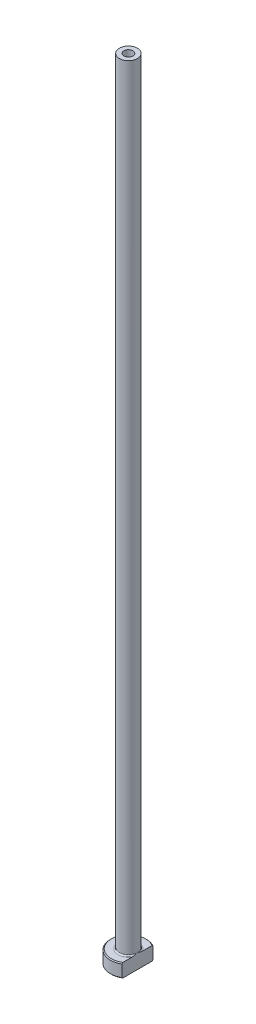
ISO-10303-21;
HEADER;
FILE_DESCRIPTION(('STEP AP214'),'2;1');
FILE_NAME('part.step','',(''),(''),'','','');
FILE_SCHEMA(('AUTOMOTIVE_DESIGN { 1 0 10303 214 1 1 1 1 }'));
ENDSEC;
DATA;
#1=APPLICATION_CONTEXT('core data for automotive mechanical design processes');
#2=APPLICATION_PROTOCOL_DEFINITION('international standard','automotive_design',2000,#1);
#3=PRODUCT_CONTEXT('',#1,'mechanical');
#4=PRODUCT('Part','Part','',(#3));
#5=PRODUCT_RELATED_PRODUCT_CATEGORY('part','',(#4));
#6=PRODUCT_DEFINITION_FORMATION('','',#4);
#7=PRODUCT_DEFINITION_CONTEXT('part definition',#1,'design');
#8=PRODUCT_DEFINITION('design','',#6,#7);
#9=PRODUCT_DEFINITION_SHAPE('','',#8);
#10=(LENGTH_UNIT() NAMED_UNIT(*) SI_UNIT(.MILLI.,.METRE.));
#11=(NAMED_UNIT(*) PLANE_ANGLE_UNIT() SI_UNIT($,.RADIAN.));
#12=(NAMED_UNIT(*) SI_UNIT($,.STERADIAN.) SOLID_ANGLE_UNIT());
#13=UNCERTAINTY_MEASURE_WITH_UNIT(LENGTH_MEASURE(1.E-05),#10,'distance_accuracy_value','');
#14=(GEOMETRIC_REPRESENTATION_CONTEXT(3) GLOBAL_UNCERTAINTY_ASSIGNED_CONTEXT((#13)) GLOBAL_UNIT_ASSIGNED_CONTEXT((#10,
#11,#12)) REPRESENTATION_CONTEXT('',''));
#15=CARTESIAN_POINT('',(0.,0.,0.));
#16=DIRECTION('',(0.,0.,1.));
#17=DIRECTION('',(1.,0.,0.));
#18=AXIS2_PLACEMENT_3D('',#15,#16,#17);
#19=CARTESIAN_POINT('',(0.,92.1876809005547,0.));
#20=DIRECTION('',(0.,1.,0.));
#21=DIRECTION('',(0.,0.,1.));
#22=AXIS2_PLACEMENT_3D('',#19,#20,#21);
#23=CYLINDRICAL_SURFACE('',#22,1.);
#24=CARTESIAN_POINT('',(0.,175.,0.));
#25=DIRECTION('',(0.,1.,0.));
#26=DIRECTION('',(0.,0.,1.));
#27=AXIS2_PLACEMENT_3D('',#24,#25,#26);
#28=CIRCLE('',#27,1.);
#29=CARTESIAN_POINT('',(0.,175.,1.));
#30=VERTEX_POINT('',#29);
#31=EDGE_CURVE('E167',#30,#30,#28,.T.);
#32=ORIENTED_EDGE('',*,*,#31,.T.);
#33=EDGE_LOOP('',(#32));
#34=FACE_BOUND('',#33,.T.);
#35=CARTESIAN_POINT('',(0.,140.,0.));
#36=DIRECTION('',(0.,1.,0.));
#37=DIRECTION('',(0.,0.,1.));
#38=AXIS2_PLACEMENT_3D('',#35,#36,#37);
#39=CIRCLE('',#38,1.);
#40=CARTESIAN_POINT('',(0.,140.,1.));
#41=VERTEX_POINT('',#40);
#42=EDGE_CURVE('E170',#41,#41,#39,.T.);
#43=ORIENTED_EDGE('',*,*,#42,.F.);
#44=EDGE_LOOP('',(#43));
#45=FACE_BOUND('',#44,.T.);
#46=ADVANCED_FACE('F32',(#34,#45),#23,.F.);
#47=CARTESIAN_POINT('',(-1.,175.,0.));
#48=DIRECTION('',(0.,1.,0.));
#49=DIRECTION('',(0.,0.,1.));
#50=AXIS2_PLACEMENT_3D('',#47,#48,#49);
#51=PLANE('',#50);
#52=CARTESIAN_POINT('',(0.,175.,0.));
#53=DIRECTION('',(0.,1.,0.));
#54=DIRECTION('',(0.,0.,1.));
#55=AXIS2_PLACEMENT_3D('',#52,#53,#54);
#56=CIRCLE('',#55,2.00000000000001);
#57=CARTESIAN_POINT('',(0.,175.,2.00000000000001));
#58=VERTEX_POINT('',#57);
#59=EDGE_CURVE('E174',#58,#58,#56,.T.);
#60=ORIENTED_EDGE('',*,*,#59,.T.);
#61=EDGE_LOOP('',(#60));
#62=FACE_BOUND('',#61,.T.);
#63=ORIENTED_EDGE('',*,*,#31,.F.);
#64=EDGE_LOOP('',(#63));
#65=FACE_BOUND('',#64,.T.);
#66=ADVANCED_FACE('F157',(#62,#65),#51,.T.);
#67=CARTESIAN_POINT('',(0.,92.1876809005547,0.));
#68=DIRECTION('',(0.,1.,0.));
#69=DIRECTION('',(0.,0.,1.));
#70=AXIS2_PLACEMENT_3D('',#67,#68,#69);
#71=CYLINDRICAL_SURFACE('',#70,2.);
#72=CARTESIAN_POINT('',(0.,3.3,0.));
#73=DIRECTION('',(0.,1.,0.));
#74=DIRECTION('',(0.,0.,1.));
#75=AXIS2_PLACEMENT_3D('',#72,#73,#74);
#76=CIRCLE('',#75,2.);
#77=CARTESIAN_POINT('',(2.,3.3,0.));
#78=VERTEX_POINT('',#77);
#79=EDGE_CURVE('E180',#78,#78,#76,.T.);
#80=ORIENTED_EDGE('',*,*,#79,.T.);
#81=EDGE_LOOP('',(#80));
#82=FACE_BOUND('',#81,.T.);
#83=ORIENTED_EDGE('',*,*,#59,.F.);
#84=EDGE_LOOP('',(#83));
#85=FACE_BOUND('',#84,.T.);
#86=ADVANCED_FACE('F162',(#82,#85),#71,.T.);
#87=CARTESIAN_POINT('',(-1.99999999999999,3.,0.));
#88=DIRECTION('',(0.,1.,0.));
#89=DIRECTION('',(0.,0.,1.));
#90=AXIS2_PLACEMENT_3D('',#87,#88,#89);
#91=PLANE('',#90);
#92=DIRECTION('',(0.,0.,1.));
#93=VECTOR('',#92,1.);
#94=CARTESIAN_POINT('',(2.,3.,0.));
#95=LINE('',#94,#93);
#96=CARTESIAN_POINT('',(2.,3.,-3.23109888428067));
#97=VERTEX_POINT('',#96);
#98=CARTESIAN_POINT('',(2.,3.,-1.13578166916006));
#99=VERTEX_POINT('',#98);
#100=EDGE_CURVE('E54',#97,#99,#95,.T.);
#101=ORIENTED_EDGE('',*,*,#100,.F.);
#102=CARTESIAN_POINT('',(0.,3.,0.));
#103=DIRECTION('',(0.,1.,0.));
#104=DIRECTION('',(0.,0.,1.));
#105=AXIS2_PLACEMENT_3D('',#102,#103,#104);
#106=CIRCLE('',#105,3.79999999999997);
#107=CARTESIAN_POINT('',(1.99999999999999,2.99999999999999,3.23109888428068));
#108=VERTEX_POINT('',#107);
#109=EDGE_CURVE('E186',#97,#108,#106,.T.);
#110=ORIENTED_EDGE('',*,*,#109,.T.);
#111=CARTESIAN_POINT('',(2.,3.,1.13578166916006));
#112=VERTEX_POINT('',#111);
#113=EDGE_CURVE('E134',#112,#108,#95,.T.);
#114=ORIENTED_EDGE('',*,*,#113,.F.);
#115=CARTESIAN_POINT('',(0.,3.,0.));
#116=DIRECTION('',(0.,1.,0.));
#117=DIRECTION('',(0.,0.,1.));
#118=AXIS2_PLACEMENT_3D('',#115,#116,#117);
#119=CIRCLE('',#118,2.3);
#120=EDGE_CURVE('E183',#112,#99,#119,.F.);
#121=ORIENTED_EDGE('',*,*,#120,.T.);
#122=EDGE_LOOP('',(#101,#110,#114,#121));
#123=FACE_BOUND('',#122,.T.);
#124=ADVANCED_FACE('F197',(#123),#91,.T.);
#125=CARTESIAN_POINT('',(0.,92.1876809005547,0.));
#126=DIRECTION('',(0.,1.,0.));
#127=DIRECTION('',(0.,0.,1.));
#128=AXIS2_PLACEMENT_3D('',#125,#126,#127);
#129=CYLINDRICAL_SURFACE('',#128,3.99999999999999);
#130=DIRECTION('',(0.,-1.,0.));
#131=VECTOR('',#130,1.);
#132=CARTESIAN_POINT('',(1.99999999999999,175.,3.46410161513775));
#133=LINE('',#132,#131);
#134=CARTESIAN_POINT('',(1.99999999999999,2.79999999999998,3.46410161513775));
#135=VERTEX_POINT('',#134);
#136=CARTESIAN_POINT('',(1.99999999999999,0.199999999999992,3.46410161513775));
#137=VERTEX_POINT('',#136);
#138=EDGE_CURVE('E82',#135,#137,#133,.T.);
#139=ORIENTED_EDGE('',*,*,#138,.F.);
#140=CARTESIAN_POINT('',(0.,2.79999999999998,0.));
#141=DIRECTION('',(0.,1.,0.));
#142=DIRECTION('',(0.,0.,1.));
#143=AXIS2_PLACEMENT_3D('',#140,#141,#142);
#144=CIRCLE('',#143,3.99999999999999);
#145=CARTESIAN_POINT('',(2.,2.79999999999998,-3.46410161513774));
#146=VERTEX_POINT('',#145);
#147=EDGE_CURVE('E95',#135,#146,#144,.F.);
#148=ORIENTED_EDGE('',*,*,#147,.T.);
#149=DIRECTION('',(0.,-1.,0.));
#150=VECTOR('',#149,1.);
#151=CARTESIAN_POINT('',(2.,175.,-3.46410161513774));
#152=LINE('',#151,#150);
#153=CARTESIAN_POINT('',(2.,0.199999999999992,-3.46410161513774));
#154=VERTEX_POINT('',#153);
#155=EDGE_CURVE('E192',#146,#154,#152,.T.);
#156=ORIENTED_EDGE('',*,*,#155,.T.);
#157=CARTESIAN_POINT('',(0.,0.199999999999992,0.));
#158=DIRECTION('',(0.,-1.,0.));
#159=DIRECTION('',(0.,0.,-1.));
#160=AXIS2_PLACEMENT_3D('',#157,#158,#159);
#161=CIRCLE('',#160,3.99999999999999);
#162=EDGE_CURVE('E98',#154,#137,#161,.F.);
#163=ORIENTED_EDGE('',*,*,#162,.T.);
#164=EDGE_LOOP('',(#139,#148,#156,#163));
#165=FACE_BOUND('',#164,.T.);
#166=ADVANCED_FACE('F190',(#165),#129,.T.);
#167=CARTESIAN_POINT('',(-3.99999999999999,0.,0.));
#168=DIRECTION('',(0.,-1.,0.));
#169=DIRECTION('',(0.,0.,-1.));
#170=AXIS2_PLACEMENT_3D('',#167,#168,#169);
#171=PLANE('',#170);
#172=CARTESIAN_POINT('',(0.,0.,0.));
#173=DIRECTION('',(0.,-1.,0.));
#174=DIRECTION('',(0.,0.,-1.));
#175=AXIS2_PLACEMENT_3D('',#172,#173,#174);
#176=CIRCLE('',#175,1.74999999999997);
#177=CARTESIAN_POINT('',(0.,0.,-1.74999999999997));
#178=VERTEX_POINT('',#177);
#179=EDGE_CURVE('E40',#178,#178,#176,.F.);
#180=ORIENTED_EDGE('',*,*,#179,.T.);
#181=EDGE_LOOP('',(#180));
#182=FACE_BOUND('',#181,.T.);
#183=DIRECTION('',(0.,0.,-1.));
#184=VECTOR('',#183,1.);
#185=CARTESIAN_POINT('',(1.99999999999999,0.,3.46410161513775));
#186=LINE('',#185,#184);
#187=CARTESIAN_POINT('',(1.99999999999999,0.,3.2310988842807));
#188=VERTEX_POINT('',#187);
#189=CARTESIAN_POINT('',(2.,0.,-3.2310988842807));
#190=VERTEX_POINT('',#189);
#191=EDGE_CURVE('E47',#188,#190,#186,.T.);
#192=ORIENTED_EDGE('',*,*,#191,.F.);
#193=CARTESIAN_POINT('',(0.,0.,0.));
#194=DIRECTION('',(0.,-1.,0.));
#195=DIRECTION('',(0.,0.,-1.));
#196=AXIS2_PLACEMENT_3D('',#193,#194,#195);
#197=CIRCLE('',#196,3.8);
#198=EDGE_CURVE('E92',#188,#190,#197,.T.);
#199=ORIENTED_EDGE('',*,*,#198,.T.);
#200=EDGE_LOOP('',(#192,#199));
#201=FACE_BOUND('',#200,.T.);
#202=ADVANCED_FACE('F91',(#182,#201),#171,.T.);
#203=CARTESIAN_POINT('',(0.,92.1876809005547,0.));
#204=DIRECTION('',(0.,1.,0.));
#205=DIRECTION('',(0.,0.,1.));
#206=AXIS2_PLACEMENT_3D('',#203,#204,#205);
#207=CYLINDRICAL_SURFACE('',#206,1.25);
#208=CARTESIAN_POINT('',(0.,0.499999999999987,0.));
#209=DIRECTION('',(0.,-1.,0.));
#210=DIRECTION('',(0.,0.,-1.));
#211=AXIS2_PLACEMENT_3D('',#208,#209,#210);
#212=CIRCLE('',#211,1.25);
#213=CARTESIAN_POINT('',(0.,0.499999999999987,-1.25));
#214=VERTEX_POINT('',#213);
#215=EDGE_CURVE('E11',#214,#214,#212,.T.);
#216=ORIENTED_EDGE('',*,*,#215,.T.);
#217=EDGE_LOOP('',(#216));
#218=FACE_BOUND('',#217,.T.);
#219=CARTESIAN_POINT('',(0.,128.,0.));
#220=DIRECTION('',(0.,1.,0.));
#221=DIRECTION('',(0.,0.,1.));
#222=AXIS2_PLACEMENT_3D('',#219,#220,#221);
#223=CIRCLE('',#222,1.25000000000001);
#224=CARTESIAN_POINT('',(0.,128.,1.25000000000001));
#225=VERTEX_POINT('',#224);
#226=EDGE_CURVE('E172',#225,#225,#223,.T.);
#227=ORIENTED_EDGE('',*,*,#226,.T.);
#228=EDGE_LOOP('',(#227));
#229=FACE_BOUND('',#228,.T.);
#230=ADVANCED_FACE('F215',(#218,#229),#207,.F.);
#231=CARTESIAN_POINT('',(0.,128.,0.));
#232=DIRECTION('',(0.,-1.,0.));
#233=DIRECTION('',(0.,0.,-1.));
#234=AXIS2_PLACEMENT_3D('',#231,#232,#233);
#235=CONICAL_SURFACE('',#234,1.25000000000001,0.0208303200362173);
#236=ORIENTED_EDGE('',*,*,#42,.T.);
#237=EDGE_LOOP('',(#236));
#238=FACE_BOUND('',#237,.T.);
#239=ORIENTED_EDGE('',*,*,#226,.F.);
#240=EDGE_LOOP('',(#239));
#241=FACE_BOUND('',#240,.T.);
#242=ADVANCED_FACE('F111',(#238,#241),#235,.F.);
#243=CARTESIAN_POINT('',(0.,3.3,0.));
#244=DIRECTION('',(0.,1.,0.));
#245=DIRECTION('',(0.,0.,1.));
#246=AXIS2_PLACEMENT_3D('',#243,#244,#245);
#247=TOROIDAL_SURFACE('',#246,2.3,0.3);
#248=ORIENTED_EDGE('',*,*,#120,.F.);
#249=CARTESIAN_POINT('',(2.,3.3,0.));
#250=CARTESIAN_POINT('',(2.,3.30000062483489,7.91126315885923E-11));
#251=CARTESIAN_POINT('',(2.,3.30000124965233,1.38467007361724E-07));
#252=CARTESIAN_POINT('',(2.,3.30000244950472,5.72507203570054E-07));
#253=CARTESIAN_POINT('',(2.,3.30000302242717,8.72849131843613E-07));
#254=CARTESIAN_POINT('',(2.,3.30000416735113,1.59335968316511E-06));
#255=CARTESIAN_POINT('',(2.,3.30000473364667,2.02244727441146E-06));
#256=CARTESIAN_POINT('',(2.,3.3000057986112,2.94494887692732E-06));
#257=CARTESIAN_POINT('',(2.,3.30000629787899,3.43770353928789E-06));
#258=CARTESIAN_POINT('',(2.,3.30000798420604,5.21460140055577E-06));
#259=CARTESIAN_POINT('',(2.,3.30000908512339,6.58180994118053E-06));
#260=CARTESIAN_POINT('',(2.,3.30001103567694,9.39775423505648E-06));
#261=CARTESIAN_POINT('',(2.,3.300011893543,1.08411110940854E-05));
#262=CARTESIAN_POINT('',(2.,3.30001514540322,1.65122791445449E-05));
#263=CARTESIAN_POINT('',(2.,3.30001737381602,2.08398803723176E-05));
#264=CARTESIAN_POINT('',(2.,3.30002099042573,2.93440788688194E-05));
#265=CARTESIAN_POINT('',(2.,3.30002243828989,3.34960322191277E-05));
#266=CARTESIAN_POINT('',(2.,3.30002863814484,5.12890612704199E-05));
#267=CARTESIAN_POINT('',(2.,3.3000333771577,6.49250989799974E-05));
#268=CARTESIAN_POINT('',(1.99999999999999,3.30004093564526,9.03829890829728E-05));
#269=CARTESIAN_POINT('',(1.99999999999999,3.30004394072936,0.00010214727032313));
#270=CARTESIAN_POINT('',(2.,3.30006787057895,0.000188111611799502));
#271=CARTESIAN_POINT('',(2.,3.3000985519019,0.000259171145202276));
#272=CARTESIAN_POINT('',(1.99999999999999,3.30021378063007,0.000536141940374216));
#273=CARTESIAN_POINT('',(1.99999999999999,3.30029106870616,0.00074423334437));
#274=CARTESIAN_POINT('',(2.,3.30059644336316,0.0015544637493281));
#275=CARTESIAN_POINT('',(2.,3.30083214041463,0.00215436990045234));
#276=CARTESIAN_POINT('',(1.99999999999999,3.30179425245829,0.00461477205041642));
#277=CARTESIAN_POINT('',(1.99999999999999,3.30251207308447,0.0064777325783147));
#278=CARTESIAN_POINT('',(2.00000000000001,3.3131163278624,0.033984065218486));
#279=CARTESIAN_POINT('',(2.,3.32306890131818,0.0596088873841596));
#280=CARTESIAN_POINT('',(1.99999999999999,3.34248629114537,0.109946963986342));
#281=CARTESIAN_POINT('',(1.99999999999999,3.3519554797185,0.134658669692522));
#282=CARTESIAN_POINT('',(2.,3.37186796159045,0.187046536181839));
#283=CARTESIAN_POINT('',(2.,3.38229466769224,0.214729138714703));
#284=CARTESIAN_POINT('',(1.99999999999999,3.40297705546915,0.270480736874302));
#285=CARTESIAN_POINT('',(1.99999999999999,3.41322989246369,0.298550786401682));
#286=CARTESIAN_POINT('',(1.99999999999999,3.43806738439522,0.368007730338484));
#287=CARTESIAN_POINT('',(1.99999999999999,3.45243182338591,0.409474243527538));
#288=CARTESIAN_POINT('',(1.99999999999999,3.47965482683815,0.491807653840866));
#289=CARTESIAN_POINT('',(1.99999999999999,3.49254110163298,0.53266532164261));
#290=CARTESIAN_POINT('',(1.99999999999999,3.51851192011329,0.620554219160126));
#291=CARTESIAN_POINT('',(1.99999999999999,3.53137383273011,0.667652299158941));
#292=CARTESIAN_POINT('',(1.99999999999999,3.55459547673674,0.762854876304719));
#293=CARTESIAN_POINT('',(1.99999999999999,3.5649353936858,0.810964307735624));
#294=CARTESIAN_POINT('',(1.99999999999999,3.58270957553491,0.910933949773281));
#295=CARTESIAN_POINT('',(1.99999999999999,3.58991426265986,0.962836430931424));
#296=CARTESIAN_POINT('',(1.99999999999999,3.59906919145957,1.06698400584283));
#297=CARTESIAN_POINT('',(1.99999999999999,3.60103790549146,1.11922724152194));
#298=CARTESIAN_POINT('',(1.99999999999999,3.59819318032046,1.21399009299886));
#299=CARTESIAN_POINT('',(1.99999999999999,3.59455548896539,1.256538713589));
#300=CARTESIAN_POINT('',(1.99999999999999,3.58116512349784,1.34017723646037));
#301=CARTESIAN_POINT('',(1.99999999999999,3.57150205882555,1.38127935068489));
#302=CARTESIAN_POINT('',(1.99999999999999,3.55087659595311,1.44109771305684));
#303=CARTESIAN_POINT('',(1.99999999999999,3.54291246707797,1.46084510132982));
#304=CARTESIAN_POINT('',(1.99999999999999,3.52453399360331,1.49924523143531));
#305=CARTESIAN_POINT('',(1.99999999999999,3.51411538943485,1.51789599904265));
#306=CARTESIAN_POINT('',(1.99999999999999,3.49255299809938,1.55022658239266));
#307=CARTESIAN_POINT('',(1.99999999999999,3.48185951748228,1.5642035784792));
#308=CARTESIAN_POINT('',(1.99999999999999,3.45839348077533,1.5902875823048));
#309=CARTESIAN_POINT('',(1.99999999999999,3.44562585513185,1.60239889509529));
#310=CARTESIAN_POINT('',(1.99999999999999,3.42183279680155,1.62093425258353));
#311=CARTESIAN_POINT('',(1.99999999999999,3.41131183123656,1.62800294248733));
#312=CARTESIAN_POINT('',(1.99999999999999,3.38926242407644,1.64036132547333));
#313=CARTESIAN_POINT('',(1.99999999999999,3.3777345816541,1.645652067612));
#314=CARTESIAN_POINT('',(1.99999999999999,3.35379760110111,1.65410966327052));
#315=CARTESIAN_POINT('',(1.99999999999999,3.34138166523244,1.65725762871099));
#316=CARTESIAN_POINT('',(1.99999999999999,3.31617371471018,1.66106000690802));
#317=CARTESIAN_POINT('',(1.99999999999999,3.30338200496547,1.66171638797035));
#318=CARTESIAN_POINT('',(1.99999999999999,3.27959278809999,1.66055848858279));
#319=CARTESIAN_POINT('',(1.99999999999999,3.26857876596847,1.6590551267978));
#320=CARTESIAN_POINT('',(1.99999999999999,3.24695777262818,1.65423593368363));
#321=CARTESIAN_POINT('',(1.99999999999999,3.23635086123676,1.6509198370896));
#322=CARTESIAN_POINT('',(1.99999999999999,3.21566894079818,1.6426469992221));
#323=CARTESIAN_POINT('',(1.99999999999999,3.20560117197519,1.63767239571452));
#324=CARTESIAN_POINT('',(1.99999999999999,3.18626855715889,1.62636415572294));
#325=CARTESIAN_POINT('',(1.99999999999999,3.17700400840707,1.62003001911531));
#326=CARTESIAN_POINT('',(1.99999999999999,3.15429988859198,1.60233802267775));
#327=CARTESIAN_POINT('',(1.99999999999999,3.14148777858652,1.59017362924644));
#328=CARTESIAN_POINT('',(1.99999999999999,3.11794267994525,1.5639653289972));
#329=CARTESIAN_POINT('',(1.99999999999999,3.10721625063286,1.54991572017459));
#330=CARTESIAN_POINT('',(1.99999999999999,3.08234423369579,1.51253200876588));
#331=CARTESIAN_POINT('',(1.99999999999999,3.06952968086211,1.48831711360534));
#332=CARTESIAN_POINT('',(1.99999999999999,3.04773953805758,1.43832020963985));
#333=CARTESIAN_POINT('',(1.99999999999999,3.03876197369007,1.41253901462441));
#334=CARTESIAN_POINT('',(1.99999999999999,3.0185075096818,1.34101817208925));
#335=CARTESIAN_POINT('',(1.99999999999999,3.01031623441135,1.29441496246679));
#336=CARTESIAN_POINT('',(1.99999999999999,3.00061264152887,1.19993212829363));
#337=CARTESIAN_POINT('',(1.99999999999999,2.99920833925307,1.15204398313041));
#338=CARTESIAN_POINT('',(1.99999999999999,3.00193088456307,1.0424696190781));
#339=CARTESIAN_POINT('',(1.99999999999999,3.0077920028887,0.980836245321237));
#340=CARTESIAN_POINT('',(1.99999999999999,3.02562921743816,0.858294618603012));
#341=CARTESIAN_POINT('',(1.99999999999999,3.03763032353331,0.797390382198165));
#342=CARTESIAN_POINT('',(1.99999999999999,3.0649490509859,0.681046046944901));
#343=CARTESIAN_POINT('',(1.99999999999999,3.07996031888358,0.625531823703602));
#344=CARTESIAN_POINT('',(1.99999999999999,3.11250087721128,0.51580518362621));
#345=CARTESIAN_POINT('',(1.99999999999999,3.13000629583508,0.461585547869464));
#346=CARTESIAN_POINT('',(1.99999999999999,3.1581473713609,0.379074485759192));
#347=CARTESIAN_POINT('',(1.99999999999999,3.16814918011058,0.350562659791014));
#348=CARTESIAN_POINT('',(1.99999999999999,3.18879761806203,0.292954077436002));
#349=CARTESIAN_POINT('',(1.99999999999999,3.19945417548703,0.263860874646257));
#350=CARTESIAN_POINT('',(1.99999999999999,3.21767622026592,0.214869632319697));
#351=CARTESIAN_POINT('',(2.,3.22516548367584,0.194943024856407));
#352=CARTESIAN_POINT('',(1.99999999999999,3.24017206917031,0.155327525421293));
#353=CARTESIAN_POINT('',(1.99999999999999,3.24768836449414,0.135638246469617));
#354=CARTESIAN_POINT('',(2.,3.26198776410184,0.098344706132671));
#355=CARTESIAN_POINT('',(2.,3.26876515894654,0.0807381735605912));
#356=CARTESIAN_POINT('',(1.99999999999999,3.28263254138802,0.0448719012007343));
#357=CARTESIAN_POINT('',(1.99999999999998,3.28972459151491,0.0266128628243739));
#358=CARTESIAN_POINT('',(2.,3.29748742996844,0.00647923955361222));
#359=CARTESIAN_POINT('',(2.,3.29820461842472,0.00461774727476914));
#360=CARTESIAN_POINT('',(1.99999999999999,3.29916656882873,0.00215769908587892));
#361=CARTESIAN_POINT('',(1.99999999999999,3.29940270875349,0.00155667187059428));
#362=CARTESIAN_POINT('',(2.,3.29970861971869,0.000745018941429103));
#363=CARTESIAN_POINT('',(2.,3.29978601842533,0.000536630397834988));
#364=CARTESIAN_POINT('',(1.99999999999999,3.29990139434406,0.000259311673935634));
#365=CARTESIAN_POINT('',(1.99999999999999,3.29993209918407,0.000188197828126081));
#366=CARTESIAN_POINT('',(2.,3.29995604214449,0.000102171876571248));
#367=CARTESIAN_POINT('',(2.,3.29995904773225,9.04036006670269E-05));
#368=CARTESIAN_POINT('',(2.,3.29996660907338,6.49368813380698E-05));
#369=CARTESIAN_POINT('',(2.,3.29997135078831,5.12961169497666E-05));
#370=CARTESIAN_POINT('',(2.,3.29997755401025,3.34977873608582E-05));
#371=CARTESIAN_POINT('',(2.,3.29997900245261,2.93452203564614E-05));
#372=CARTESIAN_POINT('',(2.,3.29998262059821,2.08398588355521E-05));
#373=CARTESIAN_POINT('',(2.,3.29998485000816,1.65117314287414E-05));
#374=CARTESIAN_POINT('',(2.,3.29998810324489,1.08400645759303E-05));
#375=CARTESIAN_POINT('',(2.,3.29998896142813,9.39666000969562E-06));
#376=CARTESIAN_POINT('',(2.,3.29999091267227,6.58068269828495E-06));
#377=CARTESIAN_POINT('',(2.,3.29999201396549,5.21349229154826E-06));
#378=CARTESIAN_POINT('',(2.,3.29999370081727,3.43669381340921E-06));
#379=CARTESIAN_POINT('',(2.,3.29999420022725,2.94398270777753E-06));
#380=CARTESIAN_POINT('',(2.,3.2999952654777,2.0215937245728E-06));
#381=CARTESIAN_POINT('',(2.,3.29999583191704,1.59257551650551E-06));
#382=CARTESIAN_POINT('',(2.,3.29999697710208,8.72232559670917E-07));
#383=CARTESIAN_POINT('',(2.,3.29999755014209,5.71985182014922E-07));
#384=CARTESIAN_POINT('',(2.,3.29999875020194,1.3817507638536E-07));
#385=CARTESIAN_POINT('',(2.,3.29999937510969,-7.91191468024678E-11));
#386=CARTESIAN_POINT('',(2.,3.3,0.));
#387=B_SPLINE_CURVE_WITH_KNOTS('',3,(#249,#250,#251,#252,#253,#254,#255,#256,#257,#258,#259,
#260,#261,#262,#263,#264,#265,#266,#267,#268,#269,#270,#271,#272,#273,#274,#275,#276,#277,#278,
#279,#280,#281,#282,#283,#284,#285,#286,#287,#288,#289,#290,#291,#292,#293,#294,#295,#296,#297,
#298,#299,#300,#301,#302,#303,#304,#305,#306,#307,#308,#309,#310,#311,#312,#313,#314,#315,#316,
#317,#318,#319,#320,#321,#322,#323,#324,#325,#326,#327,#328,#329,#330,#331,#332,#333,#334,#335,
#336,#337,#338,#339,#340,#341,#342,#343,#344,#345,#346,#347,#348,#349,#350,#351,#352,#353,#354,
#355,#356,#357,#358,#359,#360,#361,#362,#363,#364,#365,#366,#367,#368,#369,#370,#371,#372,#373,
#374,#375,#376,#377,#378,#379,#380,#381,#382,#383,#384,#385,#386),.UNSPECIFIED.,.T.,.F.,(4,2,2,
2,2,2,2,2,2,2,2,2,2,2,2,2,2,2,2,2,2,2,2,2,2,2,2,2,2,2,2,2,2,2,2,2,2,2,2,2,2,2,2,2,2,2,2,2,2,2,2,
2,2,2,2,2,2,2,2,2,2,2,2,2,2,2,2,2,4),(0.,1.87392193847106E-06,3.8052730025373E-06,
5.92782067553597E-06,8.02992548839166E-06,1.3270792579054E-05,1.83039442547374E-05,
3.28629480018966E-05,4.60403071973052E-05,8.93409852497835E-05,0.000125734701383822,
0.000357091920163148,0.00102372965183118,0.00295649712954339,0.00894682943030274,
0.0914075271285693,0.170800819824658,0.259542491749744,0.349192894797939,0.48083183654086,
0.609336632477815,0.755749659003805,0.903278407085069,1.06029304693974,1.21675300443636,
1.34456674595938,1.47052354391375,1.53427785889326,1.59814364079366,1.65076980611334,
1.70327265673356,1.74115950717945,1.77902396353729,1.81721800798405,1.8553818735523,
1.88857073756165,1.92176445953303,1.95532789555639,1.98890369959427,2.04160283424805,
2.09446511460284,2.17619131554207,2.25787541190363,2.39903747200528,2.54243890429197,
2.72770087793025,2.91372355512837,3.08615579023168,3.25703652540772,3.34768022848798,
3.44062797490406,3.50449043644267,3.56771526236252,3.62431442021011,3.68307253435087,
3.68905809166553,3.69099447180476,3.69166206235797,3.69189359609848,3.69193000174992,
3.69197331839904,3.69198649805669,3.69200105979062,3.69200609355,3.69201133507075,
3.69201343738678,3.69201556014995,3.6920174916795,3.69201936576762),.UNSPECIFIED.);
#388=EDGE_CURVE('E126',#112,#78,#387,.T.);
#389=ORIENTED_EDGE('',*,*,#388,.T.);
#390=ORIENTED_EDGE('',*,*,#79,.F.);
#391=CARTESIAN_POINT('',(2.,3.3,0.));
#392=CARTESIAN_POINT('',(2.,3.29999937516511,-7.91120651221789E-11));
#393=CARTESIAN_POINT('',(2.,3.29999875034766,-1.38467006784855E-07));
#394=CARTESIAN_POINT('',(2.,3.29999755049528,-5.72507202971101E-07));
#395=CARTESIAN_POINT('',(2.,3.29999697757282,-8.72849131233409E-07));
#396=CARTESIAN_POINT('',(2.,3.29999583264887,-1.59335968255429E-06));
#397=CARTESIAN_POINT('',(2.,3.29999526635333,-2.02244727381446E-06));
#398=CARTESIAN_POINT('',(2.,3.2999942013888,-2.94494887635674E-06));
#399=CARTESIAN_POINT('',(2.,3.299993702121,-3.43770353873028E-06));
#400=CARTESIAN_POINT('',(2.,3.29999201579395,-5.21460140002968E-06));
#401=CARTESIAN_POINT('',(2.,3.2999909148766,-6.58180994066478E-06));
#402=CARTESIAN_POINT('',(2.,3.29998896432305,-9.39775423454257E-06));
#403=CARTESIAN_POINT('',(2.,3.29998810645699,-1.08411110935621E-05));
#404=CARTESIAN_POINT('',(2.,3.29998485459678,-1.65122791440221E-05));
#405=CARTESIAN_POINT('',(2.,3.29998262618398,-2.08398803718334E-05));
#406=CARTESIAN_POINT('',(2.,3.29997900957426,-2.93440788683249E-05));
#407=CARTESIAN_POINT('',(2.,3.29997756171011,-3.34960322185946E-05));
#408=CARTESIAN_POINT('',(2.,3.29997136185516,-5.12890612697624E-05));
#409=CARTESIAN_POINT('',(1.99999999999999,3.29996662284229,-6.4925098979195E-05));
#410=CARTESIAN_POINT('',(1.99999999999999,3.29995906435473,-9.03829890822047E-05));
#411=CARTESIAN_POINT('',(1.99999999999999,3.29995605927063,-0.000102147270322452));
#412=CARTESIAN_POINT('',(2.,3.29993212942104,-0.000188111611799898));
#413=CARTESIAN_POINT('',(1.99999999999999,3.2999014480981,-0.000259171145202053));
#414=CARTESIAN_POINT('',(1.99999999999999,3.29978621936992,-0.000536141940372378));
#415=CARTESIAN_POINT('',(1.99999999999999,3.29970893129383,-0.000744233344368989));
#416=CARTESIAN_POINT('',(2.,3.29940355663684,-0.00155446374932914));
#417=CARTESIAN_POINT('',(1.99999999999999,3.29916785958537,-0.00215436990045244));
#418=CARTESIAN_POINT('',(1.99999999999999,3.2982057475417,-0.00461477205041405));
#419=CARTESIAN_POINT('',(1.99999999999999,3.29748792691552,-0.00647773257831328));
#420=CARTESIAN_POINT('',(2.,3.28688367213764,-0.0339840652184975));
#421=CARTESIAN_POINT('',(2.,3.27693109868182,-0.0596088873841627));
#422=CARTESIAN_POINT('',(1.99999999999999,3.25751370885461,-0.10994696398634));
#423=CARTESIAN_POINT('',(1.99999999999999,3.2480445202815,-0.134658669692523));
#424=CARTESIAN_POINT('',(2.,3.22813203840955,-0.187046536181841));
#425=CARTESIAN_POINT('',(1.99999999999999,3.21770533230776,-0.214729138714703));
#426=CARTESIAN_POINT('',(1.99999999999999,3.19702294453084,-0.270480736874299));
#427=CARTESIAN_POINT('',(1.99999999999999,3.1867701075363,-0.298550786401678));
#428=CARTESIAN_POINT('',(1.99999999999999,3.16193261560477,-0.36800773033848));
#429=CARTESIAN_POINT('',(1.99999999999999,3.14756817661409,-0.409474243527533));
#430=CARTESIAN_POINT('',(1.99999999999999,3.12034517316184,-0.491807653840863));
#431=CARTESIAN_POINT('',(1.99999999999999,3.10745889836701,-0.532665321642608));
#432=CARTESIAN_POINT('',(1.99999999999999,3.08148807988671,-0.620554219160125));
#433=CARTESIAN_POINT('',(1.99999999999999,3.06862616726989,-0.66765229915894));
#434=CARTESIAN_POINT('',(1.99999999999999,3.04540452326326,-0.762854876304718));
#435=CARTESIAN_POINT('',(1.99999999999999,3.03506460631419,-0.810964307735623));
#436=CARTESIAN_POINT('',(1.99999999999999,3.01729042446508,-0.91093394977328));
#437=CARTESIAN_POINT('',(1.99999999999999,3.01008573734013,-0.962836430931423));
#438=CARTESIAN_POINT('',(1.99999999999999,3.00093080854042,-1.06698400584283));
#439=CARTESIAN_POINT('',(1.99999999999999,2.99896209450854,-1.11922724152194));
#440=CARTESIAN_POINT('',(1.99999999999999,3.00180681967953,-1.21399009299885));
#441=CARTESIAN_POINT('',(1.99999999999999,3.0054445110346,-1.256538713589));
#442=CARTESIAN_POINT('',(1.99999999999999,3.01883487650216,-1.34017723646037));
#443=CARTESIAN_POINT('',(1.99999999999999,3.02849794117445,-1.38127935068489));
#444=CARTESIAN_POINT('',(1.99999999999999,3.04912340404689,-1.44109771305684));
#445=CARTESIAN_POINT('',(1.99999999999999,3.05708753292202,-1.46084510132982));
#446=CARTESIAN_POINT('',(1.99999999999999,3.07546600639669,-1.49924523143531));
#447=CARTESIAN_POINT('',(1.99999999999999,3.08588461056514,-1.51789599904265));
#448=CARTESIAN_POINT('',(1.99999999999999,3.10744700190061,-1.55022658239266));
#449=CARTESIAN_POINT('',(1.99999999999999,3.11814048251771,-1.5642035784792));
#450=CARTESIAN_POINT('',(1.99999999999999,3.14160651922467,-1.5902875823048));
#451=CARTESIAN_POINT('',(1.99999999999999,3.15437414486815,-1.60239889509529));
#452=CARTESIAN_POINT('',(1.99999999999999,3.17816720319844,-1.62093425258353));
#453=CARTESIAN_POINT('',(1.99999999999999,3.18868816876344,-1.62800294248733));
#454=CARTESIAN_POINT('',(1.99999999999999,3.21073757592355,-1.64036132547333));
#455=CARTESIAN_POINT('',(1.99999999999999,3.2222654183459,-1.645652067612));
#456=CARTESIAN_POINT('',(1.99999999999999,3.24620239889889,-1.65410966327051));
#457=CARTESIAN_POINT('',(1.99999999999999,3.25861833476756,-1.65725762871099));
#458=CARTESIAN_POINT('',(1.99999999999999,3.28382628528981,-1.66106000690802));
#459=CARTESIAN_POINT('',(1.99999999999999,3.29661799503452,-1.66171638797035));
#460=CARTESIAN_POINT('',(1.99999999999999,3.3204072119,-1.66055848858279));
#461=CARTESIAN_POINT('',(1.99999999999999,3.33142123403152,-1.6590551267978));
#462=CARTESIAN_POINT('',(1.99999999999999,3.35304222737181,-1.65423593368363));
#463=CARTESIAN_POINT('',(1.99999999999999,3.36364913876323,-1.6509198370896));
#464=CARTESIAN_POINT('',(1.99999999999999,3.38433105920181,-1.6426469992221));
#465=CARTESIAN_POINT('',(1.99999999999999,3.3943988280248,-1.63767239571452));
#466=CARTESIAN_POINT('',(1.99999999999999,3.4137314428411,-1.62636415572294));
#467=CARTESIAN_POINT('',(1.99999999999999,3.42299599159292,-1.62003001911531));
#468=CARTESIAN_POINT('',(1.99999999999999,3.44570011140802,-1.60233802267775));
#469=CARTESIAN_POINT('',(1.99999999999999,3.45851222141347,-1.59017362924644));
#470=CARTESIAN_POINT('',(1.99999999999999,3.48205732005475,-1.5639653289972));
#471=CARTESIAN_POINT('',(1.99999999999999,3.49278374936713,-1.54991572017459));
#472=CARTESIAN_POINT('',(1.99999999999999,3.5176557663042,-1.51253200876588));
#473=CARTESIAN_POINT('',(1.99999999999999,3.53047031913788,-1.48831711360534));
#474=CARTESIAN_POINT('',(1.99999999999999,3.55226046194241,-1.43832020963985));
#475=CARTESIAN_POINT('',(1.99999999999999,3.56123802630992,-1.41253901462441));
#476=CARTESIAN_POINT('',(1.99999999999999,3.58149249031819,-1.34101817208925));
#477=CARTESIAN_POINT('',(1.99999999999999,3.58968376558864,-1.29441496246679));
#478=CARTESIAN_POINT('',(1.99999999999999,3.59938735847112,-1.19993212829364));
#479=CARTESIAN_POINT('',(1.99999999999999,3.60079166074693,-1.15204398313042));
#480=CARTESIAN_POINT('',(1.99999999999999,3.59806911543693,-1.04246961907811));
#481=CARTESIAN_POINT('',(1.99999999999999,3.59220799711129,-0.980836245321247));
#482=CARTESIAN_POINT('',(1.99999999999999,3.57437078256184,-0.858294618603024));
#483=CARTESIAN_POINT('',(1.99999999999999,3.56236967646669,-0.797390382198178));
#484=CARTESIAN_POINT('',(1.99999999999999,3.5350509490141,-0.681046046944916));
#485=CARTESIAN_POINT('',(1.99999999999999,3.52003968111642,-0.625531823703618));
#486=CARTESIAN_POINT('',(1.99999999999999,3.48749912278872,-0.515805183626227));
#487=CARTESIAN_POINT('',(1.99999999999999,3.46999370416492,-0.461585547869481));
#488=CARTESIAN_POINT('',(1.99999999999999,3.4418526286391,-0.379074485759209));
#489=CARTESIAN_POINT('',(1.99999999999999,3.43185081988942,-0.35056265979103));
#490=CARTESIAN_POINT('',(1.99999999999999,3.41120238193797,-0.292954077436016));
#491=CARTESIAN_POINT('',(1.99999999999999,3.40054582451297,-0.26386087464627));
#492=CARTESIAN_POINT('',(1.99999999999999,3.38232377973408,-0.214869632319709));
#493=CARTESIAN_POINT('',(2.,3.37483451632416,-0.194943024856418));
#494=CARTESIAN_POINT('',(1.99999999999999,3.35982793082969,-0.155327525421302));
#495=CARTESIAN_POINT('',(1.99999999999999,3.35231163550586,-0.135638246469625));
#496=CARTESIAN_POINT('',(2.,3.33801223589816,-0.0983447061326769));
#497=CARTESIAN_POINT('',(2.,3.33123484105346,-0.0807381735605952));
#498=CARTESIAN_POINT('',(1.99999999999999,3.31736745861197,-0.0448719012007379));
#499=CARTESIAN_POINT('',(1.99999999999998,3.31027540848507,-0.0266128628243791));
#500=CARTESIAN_POINT('',(2.,3.30251257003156,-0.00647923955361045));
#501=CARTESIAN_POINT('',(2.,3.30179538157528,-0.00461774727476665));
#502=CARTESIAN_POINT('',(1.99999999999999,3.30083343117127,-0.00215769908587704));
#503=CARTESIAN_POINT('',(1.99999999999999,3.30059729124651,-0.00155667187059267));
#504=CARTESIAN_POINT('',(2.,3.30029138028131,-0.000745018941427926));
#505=CARTESIAN_POINT('',(2.,3.30021398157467,-0.000536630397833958));
#506=CARTESIAN_POINT('',(1.99999999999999,3.30009860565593,-0.000259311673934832));
#507=CARTESIAN_POINT('',(1.99999999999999,3.30006790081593,-0.000188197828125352));
#508=CARTESIAN_POINT('',(2.,3.3000439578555,-0.000102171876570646));
#509=CARTESIAN_POINT('',(2.,3.30004095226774,-9.0403600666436E-05));
#510=CARTESIAN_POINT('',(2.,3.30003339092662,-6.49368813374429E-05));
#511=CARTESIAN_POINT('',(2.,3.30002864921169,-5.12961169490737E-05));
#512=CARTESIAN_POINT('',(2.,3.30002244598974,-3.34977873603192E-05));
#513=CARTESIAN_POINT('',(2.,3.30002099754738,-2.93452203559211E-05));
#514=CARTESIAN_POINT('',(2.,3.30001737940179,-2.0839858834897E-05));
#515=CARTESIAN_POINT('',(2.,3.30001514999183,-1.6511731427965E-05));
#516=CARTESIAN_POINT('',(2.,3.3000118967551,-1.08400645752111E-05));
#517=CARTESIAN_POINT('',(2.,3.30001103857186,-9.3966600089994E-06));
#518=CARTESIAN_POINT('',(2.,3.30000908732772,-6.58068269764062E-06));
#519=CARTESIAN_POINT('',(2.,3.3000079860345,-5.21349229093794E-06));
#520=CARTESIAN_POINT('',(2.,3.30000629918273,-3.43669381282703E-06));
#521=CARTESIAN_POINT('',(2.,3.30000579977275,-2.94398270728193E-06));
#522=CARTESIAN_POINT('',(2.,3.30000473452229,-2.02159372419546E-06));
#523=CARTESIAN_POINT('',(2.,3.30000416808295,-1.592575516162E-06));
#524=CARTESIAN_POINT('',(2.,3.30000302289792,-8.72232559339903E-07));
#525=CARTESIAN_POINT('',(2.,3.30000244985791,-5.71985181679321E-07));
#526=CARTESIAN_POINT('',(2.,3.30000124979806,-1.38175076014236E-07));
#527=CARTESIAN_POINT('',(2.,3.3000006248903,7.91195818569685E-11));
#528=CARTESIAN_POINT('',(2.,3.3,0.));
#529=B_SPLINE_CURVE_WITH_KNOTS('',3,(#391,#392,#393,#394,#395,#396,#397,#398,#399,#400,#401,
#402,#403,#404,#405,#406,#407,#408,#409,#410,#411,#412,#413,#414,#415,#416,#417,#418,#419,#420,
#421,#422,#423,#424,#425,#426,#427,#428,#429,#430,#431,#432,#433,#434,#435,#436,#437,#438,#439,
#440,#441,#442,#443,#444,#445,#446,#447,#448,#449,#450,#451,#452,#453,#454,#455,#456,#457,#458,
#459,#460,#461,#462,#463,#464,#465,#466,#467,#468,#469,#470,#471,#472,#473,#474,#475,#476,#477,
#478,#479,#480,#481,#482,#483,#484,#485,#486,#487,#488,#489,#490,#491,#492,#493,#494,#495,#496,
#497,#498,#499,#500,#501,#502,#503,#504,#505,#506,#507,#508,#509,#510,#511,#512,#513,#514,#515,
#516,#517,#518,#519,#520,#521,#522,#523,#524,#525,#526,#527,#528),.UNSPECIFIED.,.T.,.F.,(4,2,2,
2,2,2,2,2,2,2,2,2,2,2,2,2,2,2,2,2,2,2,2,2,2,2,2,2,2,2,2,2,2,2,2,2,2,2,2,2,2,2,2,2,2,2,2,2,2,2,2,
2,2,2,2,2,2,2,2,2,2,2,2,2,2,2,2,2,4),(0.,1.87392193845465E-06,3.80527300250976E-06,
5.92782067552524E-06,8.02992548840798E-06,1.32707925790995E-05,1.83039442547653E-05,
3.28629480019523E-05,4.6040307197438E-05,8.93409852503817E-05,0.000125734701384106,
0.000357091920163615,0.0010237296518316,0.00295649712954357,0.00894682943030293,
0.0914075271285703,0.170800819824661,0.259542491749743,0.349192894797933,0.480831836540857,
0.609336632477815,0.755749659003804,0.90327840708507,1.06029304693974,1.21675300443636,
1.34456674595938,1.47052354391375,1.53427785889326,1.59814364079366,1.65076980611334,
1.70327265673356,1.74115950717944,1.77902396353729,1.81721800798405,1.8553818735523,
1.88857073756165,1.92176445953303,1.95532789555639,1.98890369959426,2.04160283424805,
2.09446511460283,2.17619131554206,2.25787541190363,2.39903747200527,2.54243890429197,
2.72770087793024,2.91372355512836,3.08615579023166,3.25703652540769,3.34768022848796,
3.44062797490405,3.50449043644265,3.56771526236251,3.6243144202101,3.68307253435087,
3.68905809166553,3.69099447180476,3.69166206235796,3.69189359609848,3.69193000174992,
3.69197331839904,3.69198649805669,3.69200105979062,3.69200609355,3.69201133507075,
3.69201343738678,3.69201556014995,3.6920174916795,3.69201936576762),.UNSPECIFIED.);
#530=EDGE_CURVE('E135',#78,#99,#529,.T.);
#531=ORIENTED_EDGE('',*,*,#530,.T.);
#532=EDGE_LOOP('',(#248,#389,#390,#531));
#533=FACE_BOUND('',#532,.T.);
#534=ADVANCED_FACE('F141',(#533),#247,.F.);
#535=CARTESIAN_POINT('',(0.,3.,0.));
#536=DIRECTION('',(0.,-1.,0.));
#537=DIRECTION('',(0.,0.,-1.));
#538=AXIS2_PLACEMENT_3D('',#535,#536,#537);
#539=CONICAL_SURFACE('',#538,3.79999999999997,0.785398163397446);
#540=CARTESIAN_POINT('',(2.,-1.08095467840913,-7.62295524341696));
#541=CARTESIAN_POINT('',(2.,-0.913887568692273,-7.45022392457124));
#542=CARTESIAN_POINT('',(2.,-0.746999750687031,-7.27731861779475));
#543=CARTESIAN_POINT('',(2.,-0.413688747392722,-6.93105655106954));
#544=CARTESIAN_POINT('',(2.,-0.247265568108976,-6.75769978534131));
#545=CARTESIAN_POINT('',(2.,0.0850908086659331,-6.41034692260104));
#546=CARTESIAN_POINT('',(2.,0.251023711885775,-6.23635054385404));
#547=CARTESIAN_POINT('',(2.,0.582155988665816,-5.88766284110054));
#548=CARTESIAN_POINT('',(2.,0.747355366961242,-5.71297152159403));
#549=CARTESIAN_POINT('',(2.,1.07353855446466,-5.36616839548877));
#550=CARTESIAN_POINT('',(2.,1.23454099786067,-5.19407412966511));
#551=CARTESIAN_POINT('',(2.,1.55534102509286,-4.8487666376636));
#552=CARTESIAN_POINT('',(2.,1.71513861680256,-4.67555341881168));
#553=CARTESIAN_POINT('',(2.,2.03306183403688,-4.32766569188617));
#554=CARTESIAN_POINT('',(2.,2.19118781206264,-4.15299150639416));
#555=CARTESIAN_POINT('',(2.,2.50513944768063,-3.8015913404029));
#556=CARTESIAN_POINT('',(2.,2.66096519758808,-3.62486544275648));
#557=CARTESIAN_POINT('',(2.,2.90974646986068,-3.33722425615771));
#558=CARTESIAN_POINT('',(2.,3.0037614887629,-3.22722645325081));
#559=CARTESIAN_POINT('',(2.,3.19011825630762,-3.00579987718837));
#560=CARTESIAN_POINT('',(2.,3.28245983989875,-2.89437096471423));
#561=CARTESIAN_POINT('',(2.,3.46586188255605,-2.66849662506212));
#562=CARTESIAN_POINT('',(2.,3.55689849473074,-2.55403176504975));
#563=CARTESIAN_POINT('',(2.,3.73578809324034,-2.32266819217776));
#564=CARTESIAN_POINT('',(2.,3.82364184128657,-2.20577007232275));
#565=CARTESIAN_POINT('',(2.,3.99612756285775,-1.966887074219));
#566=CARTESIAN_POINT('',(1.99999999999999,4.08069035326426,-1.84485190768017));
#567=CARTESIAN_POINT('',(1.99999999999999,4.24300264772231,-1.59599329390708));
#568=CARTESIAN_POINT('',(1.99999999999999,4.32074277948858,-1.46916359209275));
#569=CARTESIAN_POINT('',(1.99999999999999,4.42869763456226,-1.27510066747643));
#570=CARTESIAN_POINT('',(1.99999999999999,4.46305374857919,-1.21018943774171));
#571=CARTESIAN_POINT('',(1.99999999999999,4.52837146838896,-1.0786883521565));
#572=CARTESIAN_POINT('',(1.99999999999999,4.55933245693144,-1.01209819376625));
#573=CARTESIAN_POINT('',(1.99999999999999,4.64566860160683,-0.809894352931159));
#574=CARTESIAN_POINT('',(1.99999999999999,4.69478214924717,-0.671360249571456));
#575=CARTESIAN_POINT('',(1.99999999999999,4.74794829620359,-0.463657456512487));
#576=CARTESIAN_POINT('',(1.99999999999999,4.7620506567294,-0.397033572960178));
#577=CARTESIAN_POINT('',(1.99999999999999,4.78390371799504,-0.262728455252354));
#578=CARTESIAN_POINT('',(1.99999999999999,4.79165498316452,-0.195047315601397));
#579=CARTESIAN_POINT('',(1.99999999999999,4.80025690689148,-0.0594528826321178));
#580=CARTESIAN_POINT('',(1.99999999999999,4.80112894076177,0.00845903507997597));
#581=CARTESIAN_POINT('',(1.99999999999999,4.79596585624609,0.144020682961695));
#582=CARTESIAN_POINT('',(1.99999999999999,4.78993016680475,0.211670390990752));
#583=CARTESIAN_POINT('',(1.99999999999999,4.77145363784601,0.345483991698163));
#584=CARTESIAN_POINT('',(1.99999999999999,4.75906777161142,0.411655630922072));
#585=CARTESIAN_POINT('',(1.99999999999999,4.7286636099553,0.542678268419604));
#586=CARTESIAN_POINT('',(1.99999999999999,4.7106446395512,0.60752910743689));
#587=CARTESIAN_POINT('',(1.99999999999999,4.66972939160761,0.736064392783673));
#588=CARTESIAN_POINT('',(1.99999999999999,4.64680564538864,0.799739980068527));
#589=CARTESIAN_POINT('',(1.99999999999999,4.5970014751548,0.925489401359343));
#590=CARTESIAN_POINT('',(1.99999999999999,4.57012185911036,0.987563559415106));
#591=CARTESIAN_POINT('',(1.99999999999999,4.48443518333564,1.17209020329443));
#592=CARTESIAN_POINT('',(1.99999999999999,4.42077407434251,1.29228210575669));
#593=CARTESIAN_POINT('',(1.99999999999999,4.28502644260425,1.52785770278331));
#594=CARTESIAN_POINT('',(1.99999999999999,4.21292931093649,1.6432350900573));
#595=CARTESIAN_POINT('',(1.99999999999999,4.0628151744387,1.87069387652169));
#596=CARTESIAN_POINT('',(1.99999999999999,3.98477595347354,1.98276048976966));
#597=CARTESIAN_POINT('',(1.99999999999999,3.82481971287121,2.20397837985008));
#598=CARTESIAN_POINT('',(1.99999999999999,3.74290465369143,2.3131310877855));
#599=CARTESIAN_POINT('',(1.99999999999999,3.57517222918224,2.53068545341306));
#600=CARTESIAN_POINT('',(1.99999999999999,3.4893176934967,2.63905831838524));
#601=CARTESIAN_POINT('',(1.99999999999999,3.31548151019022,2.85409686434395));
#602=CARTESIAN_POINT('',(1.99999999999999,3.22749963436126,2.96076236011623));
#603=CARTESIAN_POINT('',(1.99999999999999,3.05015030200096,3.17249211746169));
#604=CARTESIAN_POINT('',(1.99999999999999,2.96078672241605,3.27755963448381));
#605=CARTESIAN_POINT('',(1.99999999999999,2.78082366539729,3.48663191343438));
#606=CARTESIAN_POINT('',(1.99999999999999,2.69022416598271,3.59063665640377));
#607=CARTESIAN_POINT('',(1.99999999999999,2.44796733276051,3.86612439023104));
#608=CARTESIAN_POINT('',(1.99999999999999,2.2954597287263,4.03685912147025));
#609=CARTESIAN_POINT('',(1.99999999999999,1.98858070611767,4.37664803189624));
#610=CARTESIAN_POINT('',(1.99999999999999,1.83420923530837,4.545702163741));
#611=CARTESIAN_POINT('',(1.99999999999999,1.52396102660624,4.88271638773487));
#612=CARTESIAN_POINT('',(1.99999999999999,1.36808300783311,5.05067529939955));
#613=CARTESIAN_POINT('',(1.99999999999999,1.05530513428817,5.38563883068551));
#614=CARTESIAN_POINT('',(1.99999999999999,0.898405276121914,5.55264344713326));
#615=CARTESIAN_POINT('',(1.99999999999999,0.590290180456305,5.879053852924));
#616=CARTESIAN_POINT('',(1.99999999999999,0.439106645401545,6.0384895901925));
#617=CARTESIAN_POINT('',(1.99999999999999,0.136164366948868,6.35681456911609));
#618=CARTESIAN_POINT('',(1.99999999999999,-0.0155943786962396,6.51570380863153));
#619=CARTESIAN_POINT('',(1.99999999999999,-0.319404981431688,6.83286192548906));
#620=CARTESIAN_POINT('',(1.99999999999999,-0.47145632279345,6.99113129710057));
#621=CARTESIAN_POINT('',(1.99999999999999,-0.775939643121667,7.30730102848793));
#622=CARTESIAN_POINT('',(1.99999999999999,-0.92837161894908,7.46520139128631));
#623=CARTESIAN_POINT('',(1.99999999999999,-1.08095467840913,7.62295524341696));
#624=B_SPLINE_CURVE_WITH_KNOTS('',3,(#540,#541,#542,#543,#544,#545,#546,#547,#548,#549,#550,
#551,#552,#553,#554,#555,#556,#557,#558,#559,#560,#561,#562,#563,#564,#565,#566,#567,#568,#569,
#570,#571,#572,#573,#574,#575,#576,#577,#578,#579,#580,#581,#582,#583,#584,#585,#586,#587,#588,
#589,#590,#591,#592,#593,#594,#595,#596,#597,#598,#599,#600,#601,#602,#603,#604,#605,#606,#607,
#608,#609,#610,#611,#612,#613,#614,#615,#616,#617,#618,#619,#620,#621,#622,#623),.UNSPECIFIED.,
.F.,.F.,(4,2,2,2,2,2,2,2,2,2,2,2,2,2,2,2,2,2,2,2,2,2,2,2,2,2,2,2,2,2,2,2,2,2,2,2,2,2,2,2,2,4),
(0.,0.720921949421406,1.44185317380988,2.16315326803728,2.88444869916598,3.59144103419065,
4.298428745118,5.00526427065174,5.71207135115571,6.14616174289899,6.58029471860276,
7.0190149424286,7.45762947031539,7.9029045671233,8.3487820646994,8.56901415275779,
8.78928621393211,9.22814472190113,9.43219512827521,9.6362273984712,9.83962544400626,
10.0430403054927,10.2447232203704,10.446430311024,10.6492980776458,10.8521244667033,
11.259558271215,11.6675100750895,12.0770700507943,12.486425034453,12.9011677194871,
13.3159550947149,13.7297367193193,14.1435257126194,14.8302935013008,15.5170805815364,
16.2045145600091,16.8919508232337,17.5511045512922,18.2102608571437,18.8686819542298,
19.5270976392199),.UNSPECIFIED.);
#625=EDGE_CURVE('E133',#146,#97,#624,.T.);
#626=ORIENTED_EDGE('',*,*,#625,.F.);
#627=ORIENTED_EDGE('',*,*,#147,.F.);
#628=EDGE_CURVE('E118',#108,#135,#624,.T.);
#629=ORIENTED_EDGE('',*,*,#628,.F.);
#630=ORIENTED_EDGE('',*,*,#109,.F.);
#631=EDGE_LOOP('',(#626,#627,#629,#630));
#632=FACE_BOUND('',#631,.T.);
#633=ADVANCED_FACE('F145',(#632),#539,.T.);
#634=CARTESIAN_POINT('',(0.,0.199999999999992,0.));
#635=DIRECTION('',(0.,1.,0.));
#636=DIRECTION('',(0.,0.,1.));
#637=AXIS2_PLACEMENT_3D('',#634,#635,#636);
#638=CONICAL_SURFACE('',#637,3.99999999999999,0.785398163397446);
#639=CARTESIAN_POINT('',(1.99999999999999,4.08095467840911,7.62295524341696));
#640=CARTESIAN_POINT('',(1.99999999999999,3.91388756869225,7.45022392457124));
#641=CARTESIAN_POINT('',(1.99999999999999,3.74699975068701,7.27731861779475));
#642=CARTESIAN_POINT('',(1.99999999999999,3.4136887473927,6.93105655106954));
#643=CARTESIAN_POINT('',(1.99999999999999,3.24726556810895,6.75769978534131));
#644=CARTESIAN_POINT('',(1.99999999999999,2.91490919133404,6.41034692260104));
#645=CARTESIAN_POINT('',(1.99999999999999,2.7489762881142,6.23635054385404));
#646=CARTESIAN_POINT('',(1.99999999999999,2.41784401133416,5.88766284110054));
#647=CARTESIAN_POINT('',(1.99999999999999,2.25264463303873,5.71297152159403));
#648=CARTESIAN_POINT('',(1.99999999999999,1.92646144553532,5.36616839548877));
#649=CARTESIAN_POINT('',(1.99999999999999,1.76545900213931,5.19407412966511));
#650=CARTESIAN_POINT('',(1.99999999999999,1.44465897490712,4.8487666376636));
#651=CARTESIAN_POINT('',(1.99999999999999,1.28486138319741,4.67555341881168));
#652=CARTESIAN_POINT('',(1.99999999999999,0.966938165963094,4.32766569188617));
#653=CARTESIAN_POINT('',(1.99999999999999,0.808812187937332,4.15299150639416));
#654=CARTESIAN_POINT('',(1.99999999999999,0.49486055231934,3.80159134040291));
#655=CARTESIAN_POINT('',(1.99999999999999,0.339034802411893,3.62486544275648));
#656=CARTESIAN_POINT('',(1.99999999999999,0.0902535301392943,3.33722425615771));
#657=CARTESIAN_POINT('',(1.99999999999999,-0.00376148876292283,3.22722645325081));
#658=CARTESIAN_POINT('',(1.99999999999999,-0.190118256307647,3.00579987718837));
#659=CARTESIAN_POINT('',(1.99999999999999,-0.282459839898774,2.89437096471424));
#660=CARTESIAN_POINT('',(1.99999999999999,-0.465861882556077,2.66849662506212));
#661=CARTESIAN_POINT('',(1.99999999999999,-0.556898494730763,2.55403176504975));
#662=CARTESIAN_POINT('',(1.99999999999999,-0.735788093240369,2.32266819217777));
#663=CARTESIAN_POINT('',(1.99999999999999,-0.823641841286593,2.20577007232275));
#664=CARTESIAN_POINT('',(1.99999999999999,-0.996127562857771,1.966887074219));
#665=CARTESIAN_POINT('',(1.99999999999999,-1.08069035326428,1.84485190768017));
#666=CARTESIAN_POINT('',(1.99999999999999,-1.24300264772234,1.59599329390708));
#667=CARTESIAN_POINT('',(1.99999999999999,-1.32074277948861,1.46916359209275));
#668=CARTESIAN_POINT('',(1.99999999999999,-1.42869763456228,1.27510066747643));
#669=CARTESIAN_POINT('',(1.99999999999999,-1.46305374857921,1.21018943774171));
#670=CARTESIAN_POINT('',(1.99999999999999,-1.52837146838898,1.0786883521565));
#671=CARTESIAN_POINT('',(1.99999999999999,-1.55933245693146,1.01209819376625));
#672=CARTESIAN_POINT('',(1.99999999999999,-1.64566860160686,0.80989435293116));
#673=CARTESIAN_POINT('',(1.99999999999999,-1.69478214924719,0.671360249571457));
#674=CARTESIAN_POINT('',(1.99999999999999,-1.74794829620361,0.463657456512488));
#675=CARTESIAN_POINT('',(1.99999999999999,-1.76205065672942,0.397033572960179));
#676=CARTESIAN_POINT('',(1.99999999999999,-1.78390371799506,0.262728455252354));
#677=CARTESIAN_POINT('',(1.99999999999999,-1.79165498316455,0.195047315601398));
#678=CARTESIAN_POINT('',(1.99999999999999,-1.80025690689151,0.0594528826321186));
#679=CARTESIAN_POINT('',(1.99999999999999,-1.80112894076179,-0.00845903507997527));
#680=CARTESIAN_POINT('',(1.99999999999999,-1.79596585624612,-0.144020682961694));
#681=CARTESIAN_POINT('',(1.99999999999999,-1.78993016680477,-0.211670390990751));
#682=CARTESIAN_POINT('',(1.99999999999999,-1.77145363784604,-0.345483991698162));
#683=CARTESIAN_POINT('',(1.99999999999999,-1.75906777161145,-0.411655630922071));
#684=CARTESIAN_POINT('',(1.99999999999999,-1.72866360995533,-0.542678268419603));
#685=CARTESIAN_POINT('',(1.99999999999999,-1.71064463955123,-0.60752910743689));
#686=CARTESIAN_POINT('',(1.99999999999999,-1.66972939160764,-0.736064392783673));
#687=CARTESIAN_POINT('',(1.99999999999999,-1.64680564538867,-0.799739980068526));
#688=CARTESIAN_POINT('',(1.99999999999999,-1.59700147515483,-0.925489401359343));
#689=CARTESIAN_POINT('',(1.99999999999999,-1.57012185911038,-0.987563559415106));
#690=CARTESIAN_POINT('',(1.99999999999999,-1.48443518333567,-1.17209020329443));
#691=CARTESIAN_POINT('',(1.99999999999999,-1.42077407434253,-1.29228210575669));
#692=CARTESIAN_POINT('',(1.99999999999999,-1.28502644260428,-1.52785770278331));
#693=CARTESIAN_POINT('',(2.,-1.21292931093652,-1.6432350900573));
#694=CARTESIAN_POINT('',(2.,-1.06281517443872,-1.87069387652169));
#695=CARTESIAN_POINT('',(2.,-0.984775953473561,-1.98276048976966));
#696=CARTESIAN_POINT('',(2.,-0.824819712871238,-2.20397837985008));
#697=CARTESIAN_POINT('',(2.,-0.742904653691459,-2.3131310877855));
#698=CARTESIAN_POINT('',(2.,-0.575172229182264,-2.53068545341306));
#699=CARTESIAN_POINT('',(2.,-0.489317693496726,-2.63905831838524));
#700=CARTESIAN_POINT('',(2.,-0.315481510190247,-2.85409686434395));
#701=CARTESIAN_POINT('',(2.,-0.227499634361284,-2.96076236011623));
#702=CARTESIAN_POINT('',(2.,-0.050150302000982,-3.1724921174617));
#703=CARTESIAN_POINT('',(2.,0.039213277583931,-3.27755963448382));
#704=CARTESIAN_POINT('',(2.,0.219176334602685,-3.48663191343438));
#705=CARTESIAN_POINT('',(2.,0.309775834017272,-3.59063665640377));
#706=CARTESIAN_POINT('',(2.,0.552032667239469,-3.86612439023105));
#707=CARTESIAN_POINT('',(2.,0.704540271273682,-4.03685912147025));
#708=CARTESIAN_POINT('',(2.,1.01141929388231,-4.37664803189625));
#709=CARTESIAN_POINT('',(2.,1.16579076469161,-4.545702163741));
#710=CARTESIAN_POINT('',(2.,1.47603897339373,-4.88271638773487));
#711=CARTESIAN_POINT('',(2.,1.63191699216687,-5.05067529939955));
#712=CARTESIAN_POINT('',(2.,1.94469486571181,-5.38563883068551));
#713=CARTESIAN_POINT('',(2.,2.10159472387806,-5.55264344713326));
#714=CARTESIAN_POINT('',(2.,2.40970981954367,-5.879053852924));
#715=CARTESIAN_POINT('',(2.,2.56089335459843,-6.0384895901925));
#716=CARTESIAN_POINT('',(2.,2.86383563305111,-6.35681456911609));
#717=CARTESIAN_POINT('',(2.,3.01559437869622,-6.51570380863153));
#718=CARTESIAN_POINT('',(2.,3.31940498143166,-6.83286192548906));
#719=CARTESIAN_POINT('',(2.,3.47145632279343,-6.99113129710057));
#720=CARTESIAN_POINT('',(2.,3.77593964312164,-7.30730102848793));
#721=CARTESIAN_POINT('',(2.,3.92837161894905,-7.46520139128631));
#722=CARTESIAN_POINT('',(2.,4.08095467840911,-7.62295524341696));
#723=B_SPLINE_CURVE_WITH_KNOTS('',3,(#639,#640,#641,#642,#643,#644,#645,#646,#647,#648,#649,
#650,#651,#652,#653,#654,#655,#656,#657,#658,#659,#660,#661,#662,#663,#664,#665,#666,#667,#668,
#669,#670,#671,#672,#673,#674,#675,#676,#677,#678,#679,#680,#681,#682,#683,#684,#685,#686,#687,
#688,#689,#690,#691,#692,#693,#694,#695,#696,#697,#698,#699,#700,#701,#702,#703,#704,#705,#706,
#707,#708,#709,#710,#711,#712,#713,#714,#715,#716,#717,#718,#719,#720,#721,#722),.UNSPECIFIED.,
.F.,.F.,(4,2,2,2,2,2,2,2,2,2,2,2,2,2,2,2,2,2,2,2,2,2,2,2,2,2,2,2,2,2,2,2,2,2,2,2,2,2,2,2,2,4),
(0.,0.720921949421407,1.44185317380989,2.16315326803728,2.88444869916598,3.59144103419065,
4.298428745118,5.00526427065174,5.71207135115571,6.14616174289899,6.58029471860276,
7.01901494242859,7.45762947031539,7.9029045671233,8.3487820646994,8.56901415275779,
8.78928621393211,9.22814472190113,9.43219512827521,9.6362273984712,9.83962544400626,
10.0430403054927,10.2447232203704,10.446430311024,10.6492980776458,10.8521244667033,
11.259558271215,11.6675100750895,12.0770700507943,12.486425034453,12.9011677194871,
13.3159550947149,13.7297367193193,14.1435257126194,14.8302935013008,15.5170805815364,
16.2045145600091,16.8919508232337,17.5511045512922,18.2102608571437,18.8686819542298,
19.5270976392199),.UNSPECIFIED.);
#724=EDGE_CURVE('E79',#137,#188,#723,.T.);
#725=ORIENTED_EDGE('',*,*,#724,.F.);
#726=ORIENTED_EDGE('',*,*,#162,.F.);
#727=EDGE_CURVE('E87',#190,#154,#723,.T.);
#728=ORIENTED_EDGE('',*,*,#727,.F.);
#729=ORIENTED_EDGE('',*,*,#198,.F.);
#730=EDGE_LOOP('',(#725,#726,#728,#729));
#731=FACE_BOUND('',#730,.T.);
#732=ADVANCED_FACE('F94',(#731),#638,.T.);
#733=CARTESIAN_POINT('',(1.99999999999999,175.,3.46410161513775));
#734=DIRECTION('',(-1.,0.,0.));
#735=DIRECTION('',(0.,0.,1.));
#736=AXIS2_PLACEMENT_3D('',#733,#734,#735);
#737=PLANE('',#736);
#738=ORIENTED_EDGE('',*,*,#388,.F.);
#739=ORIENTED_EDGE('',*,*,#113,.T.);
#740=ORIENTED_EDGE('',*,*,#628,.T.);
#741=ORIENTED_EDGE('',*,*,#138,.T.);
#742=ORIENTED_EDGE('',*,*,#724,.T.);
#743=ORIENTED_EDGE('',*,*,#191,.T.);
#744=ORIENTED_EDGE('',*,*,#727,.T.);
#745=ORIENTED_EDGE('',*,*,#155,.F.);
#746=ORIENTED_EDGE('',*,*,#625,.T.);
#747=ORIENTED_EDGE('',*,*,#100,.T.);
#748=ORIENTED_EDGE('',*,*,#530,.F.);
#749=EDGE_LOOP('',(#738,#739,#740,#741,#742,#743,#744,#745,#746,#747,#748));
#750=FACE_BOUND('',#749,.T.);
#751=ADVANCED_FACE('F80',(#750),#737,.F.);
#752=CARTESIAN_POINT('',(0.,0.,0.));
#753=DIRECTION('',(0.,-1.,0.));
#754=DIRECTION('',(0.,0.,-1.));
#755=AXIS2_PLACEMENT_3D('',#752,#753,#754);
#756=CONICAL_SURFACE('',#755,1.74999999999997,0.785398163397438);
#757=ORIENTED_EDGE('',*,*,#215,.F.);
#758=EDGE_LOOP('',(#757));
#759=FACE_BOUND('',#758,.T.);
#760=ORIENTED_EDGE('',*,*,#179,.F.);
#761=EDGE_LOOP('',(#760));
#762=FACE_BOUND('',#761,.T.);
#763=ADVANCED_FACE('F34',(#759,#762),#756,.F.);
#764=CLOSED_SHELL('',(#46,#66,#86,#124,#166,#202,#230,#242,#534,#633,#732,#751,#763));
#765=MANIFOLD_SOLID_BREP('B2',#764);
#766=ADVANCED_BREP_SHAPE_REPRESENTATION('',(#18,#765),#14);
#767=SHAPE_DEFINITION_REPRESENTATION(#9,#766);
ENDSEC;
END-ISO-10303-21;
